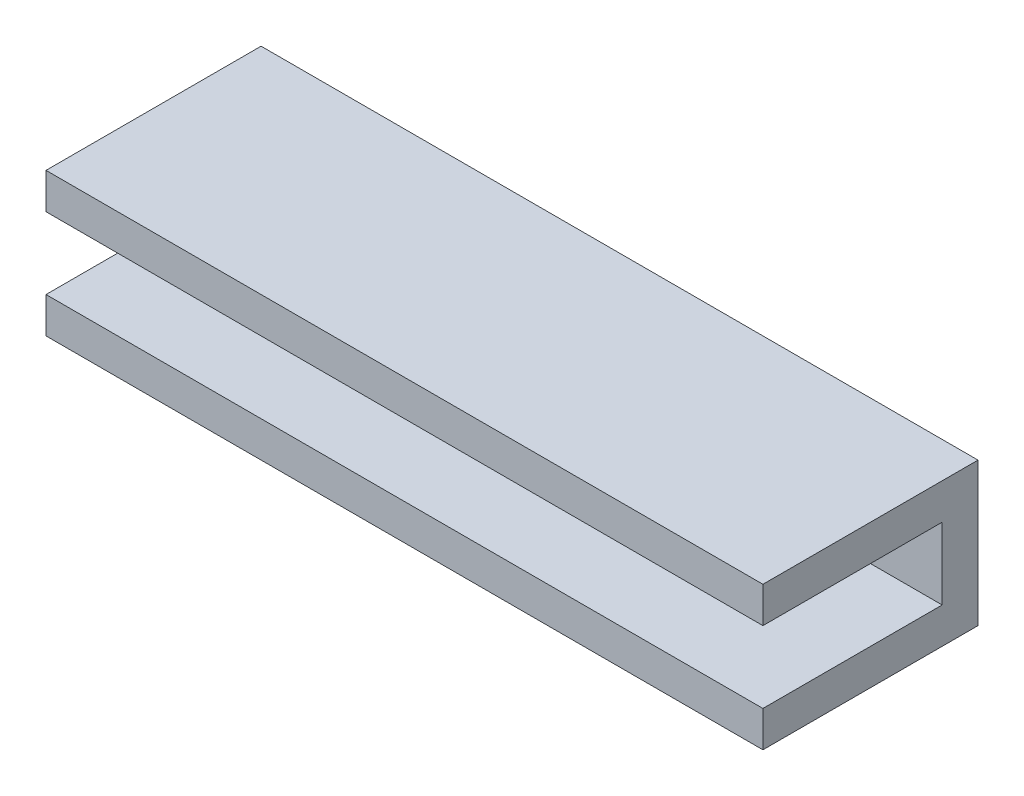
ISO-10303-21;
HEADER;
FILE_DESCRIPTION(('STEP AP214'),'2;1');
FILE_NAME('part.step','',(''),(''),'','','');
FILE_SCHEMA(('AUTOMOTIVE_DESIGN { 1 0 10303 214 1 1 1 1 }'));
ENDSEC;
DATA;
#1=APPLICATION_CONTEXT('core data for automotive mechanical design processes');
#2=APPLICATION_PROTOCOL_DEFINITION('international standard','automotive_design',2000,#1);
#3=PRODUCT_CONTEXT('',#1,'mechanical');
#4=PRODUCT('Part','Part','',(#3));
#5=PRODUCT_RELATED_PRODUCT_CATEGORY('part','',(#4));
#6=PRODUCT_DEFINITION_FORMATION('','',#4);
#7=PRODUCT_DEFINITION_CONTEXT('part definition',#1,'design');
#8=PRODUCT_DEFINITION('design','',#6,#7);
#9=PRODUCT_DEFINITION_SHAPE('','',#8);
#10=(LENGTH_UNIT() NAMED_UNIT(*) SI_UNIT(.MILLI.,.METRE.));
#11=(NAMED_UNIT(*) PLANE_ANGLE_UNIT() SI_UNIT($,.RADIAN.));
#12=(NAMED_UNIT(*) SI_UNIT($,.STERADIAN.) SOLID_ANGLE_UNIT());
#13=UNCERTAINTY_MEASURE_WITH_UNIT(LENGTH_MEASURE(1.E-05),#10,'distance_accuracy_value','');
#14=(GEOMETRIC_REPRESENTATION_CONTEXT(3) GLOBAL_UNCERTAINTY_ASSIGNED_CONTEXT((#13)) GLOBAL_UNIT_ASSIGNED_CONTEXT((#10,
#11,#12)) REPRESENTATION_CONTEXT('',''));
#15=CARTESIAN_POINT('',(0.,0.,0.));
#16=DIRECTION('',(0.,0.,1.));
#17=DIRECTION('',(1.,0.,0.));
#18=AXIS2_PLACEMENT_3D('',#15,#16,#17);
#19=CARTESIAN_POINT('',(0.,0.,30.));
#20=DIRECTION('',(0.,0.,1.));
#21=DIRECTION('',(1.,0.,0.));
#22=AXIS2_PLACEMENT_3D('',#19,#20,#21);
#23=PLANE('',#22);
#24=DIRECTION('',(0.,-1.,0.));
#25=VECTOR('',#24,1.);
#26=CARTESIAN_POINT('',(0.,20.,30.));
#27=LINE('',#26,#25);
#28=CARTESIAN_POINT('',(0.,20.,30.));
#29=VERTEX_POINT('',#28);
#30=CARTESIAN_POINT('',(0.,15.,30.));
#31=VERTEX_POINT('',#30);
#32=EDGE_CURVE('E143',#29,#31,#27,.T.);
#33=ORIENTED_EDGE('',*,*,#32,.T.);
#34=DIRECTION('',(1.,0.,0.));
#35=VECTOR('',#34,1.);
#36=CARTESIAN_POINT('',(0.,15.,30.));
#37=LINE('',#36,#35);
#38=CARTESIAN_POINT('',(100.,15.,30.));
#39=VERTEX_POINT('',#38);
#40=EDGE_CURVE('E165',#31,#39,#37,.T.);
#41=ORIENTED_EDGE('',*,*,#40,.T.);
#42=DIRECTION('',(0.,1.,0.));
#43=VECTOR('',#42,1.);
#44=CARTESIAN_POINT('',(100.,0.,30.));
#45=LINE('',#44,#43);
#46=CARTESIAN_POINT('',(100.,20.,30.));
#47=VERTEX_POINT('',#46);
#48=EDGE_CURVE('E155',#39,#47,#45,.T.);
#49=ORIENTED_EDGE('',*,*,#48,.T.);
#50=DIRECTION('',(-1.,0.,0.));
#51=VECTOR('',#50,1.);
#52=CARTESIAN_POINT('',(100.,20.,30.));
#53=LINE('',#52,#51);
#54=EDGE_CURVE('E66',#47,#29,#53,.T.);
#55=ORIENTED_EDGE('',*,*,#54,.T.);
#56=EDGE_LOOP('',(#33,#41,#49,#55));
#57=FACE_BOUND('',#56,.T.);
#58=ADVANCED_FACE('F44',(#57),#23,.T.);
#59=CARTESIAN_POINT('',(100.,0.,30.));
#60=DIRECTION('',(-1.,0.,0.));
#61=DIRECTION('',(0.,0.,1.));
#62=AXIS2_PLACEMENT_3D('',#59,#60,#61);
#63=PLANE('',#62);
#64=DIRECTION('',(0.,0.,-1.));
#65=VECTOR('',#64,1.);
#66=CARTESIAN_POINT('',(100.,5.,30.));
#67=LINE('',#66,#65);
#68=CARTESIAN_POINT('',(100.,5.,30.));
#69=VERTEX_POINT('',#68);
#70=CARTESIAN_POINT('',(100.,5.,5.));
#71=VERTEX_POINT('',#70);
#72=EDGE_CURVE('E64',#69,#71,#67,.T.);
#73=ORIENTED_EDGE('',*,*,#72,.F.);
#74=CARTESIAN_POINT('',(100.,0.,30.));
#75=VERTEX_POINT('',#74);
#76=EDGE_CURVE('E133',#75,#69,#45,.T.);
#77=ORIENTED_EDGE('',*,*,#76,.F.);
#78=DIRECTION('',(0.,0.,-1.));
#79=VECTOR('',#78,1.);
#80=CARTESIAN_POINT('',(100.,0.,30.));
#81=LINE('',#80,#79);
#82=CARTESIAN_POINT('',(100.,0.,0.));
#83=VERTEX_POINT('',#82);
#84=EDGE_CURVE('E53',#75,#83,#81,.T.);
#85=ORIENTED_EDGE('',*,*,#84,.T.);
#86=DIRECTION('',(0.,1.,0.));
#87=VECTOR('',#86,1.);
#88=CARTESIAN_POINT('',(100.,0.,0.));
#89=LINE('',#88,#87);
#90=CARTESIAN_POINT('',(100.,20.,0.));
#91=VERTEX_POINT('',#90);
#92=EDGE_CURVE('E148',#83,#91,#89,.T.);
#93=ORIENTED_EDGE('',*,*,#92,.T.);
#94=DIRECTION('',(0.,0.,-1.));
#95=VECTOR('',#94,1.);
#96=CARTESIAN_POINT('',(100.,20.,30.));
#97=LINE('',#96,#95);
#98=EDGE_CURVE('E166',#47,#91,#97,.T.);
#99=ORIENTED_EDGE('',*,*,#98,.F.);
#100=ORIENTED_EDGE('',*,*,#48,.F.);
#101=DIRECTION('',(0.,0.,1.));
#102=VECTOR('',#101,1.);
#103=CARTESIAN_POINT('',(100.,15.,5.));
#104=LINE('',#103,#102);
#105=CARTESIAN_POINT('',(100.,15.,5.));
#106=VERTEX_POINT('',#105);
#107=EDGE_CURVE('E129',#106,#39,#104,.T.);
#108=ORIENTED_EDGE('',*,*,#107,.F.);
#109=DIRECTION('',(0.,1.,0.));
#110=VECTOR('',#109,1.);
#111=CARTESIAN_POINT('',(100.,5.,5.));
#112=LINE('',#111,#110);
#113=EDGE_CURVE('E201',#71,#106,#112,.T.);
#114=ORIENTED_EDGE('',*,*,#113,.F.);
#115=EDGE_LOOP('',(#73,#77,#85,#93,#99,#100,#108,#114));
#116=FACE_BOUND('',#115,.T.);
#117=ADVANCED_FACE('F178',(#116),#63,.F.);
#118=CARTESIAN_POINT('',(0.,20.,30.));
#119=DIRECTION('',(1.,0.,0.));
#120=DIRECTION('',(0.,1.,0.));
#121=AXIS2_PLACEMENT_3D('',#118,#119,#120);
#122=PLANE('',#121);
#123=DIRECTION('',(0.,1.,0.));
#124=VECTOR('',#123,1.);
#125=CARTESIAN_POINT('',(0.,5.,5.));
#126=LINE('',#125,#124);
#127=CARTESIAN_POINT('',(0.,5.,5.));
#128=VERTEX_POINT('',#127);
#129=CARTESIAN_POINT('',(0.,15.,5.));
#130=VERTEX_POINT('',#129);
#131=EDGE_CURVE('E126',#128,#130,#126,.T.);
#132=ORIENTED_EDGE('',*,*,#131,.T.);
#133=DIRECTION('',(0.,0.,1.));
#134=VECTOR('',#133,1.);
#135=CARTESIAN_POINT('',(0.,15.,5.));
#136=LINE('',#135,#134);
#137=EDGE_CURVE('E138',#130,#31,#136,.T.);
#138=ORIENTED_EDGE('',*,*,#137,.T.);
#139=ORIENTED_EDGE('',*,*,#32,.F.);
#140=DIRECTION('',(0.,0.,-1.));
#141=VECTOR('',#140,1.);
#142=CARTESIAN_POINT('',(0.,20.,30.));
#143=LINE('',#142,#141);
#144=CARTESIAN_POINT('',(0.,20.,0.));
#145=VERTEX_POINT('',#144);
#146=EDGE_CURVE('E160',#29,#145,#143,.T.);
#147=ORIENTED_EDGE('',*,*,#146,.T.);
#148=DIRECTION('',(0.,-1.,0.));
#149=VECTOR('',#148,1.);
#150=CARTESIAN_POINT('',(0.,20.,0.));
#151=LINE('',#150,#149);
#152=CARTESIAN_POINT('',(0.,0.,0.));
#153=VERTEX_POINT('',#152);
#154=EDGE_CURVE('E158',#145,#153,#151,.T.);
#155=ORIENTED_EDGE('',*,*,#154,.T.);
#156=DIRECTION('',(0.,0.,-1.));
#157=VECTOR('',#156,1.);
#158=CARTESIAN_POINT('',(0.,0.,30.));
#159=LINE('',#158,#157);
#160=CARTESIAN_POINT('',(0.,0.,30.));
#161=VERTEX_POINT('',#160);
#162=EDGE_CURVE('E11',#161,#153,#159,.T.);
#163=ORIENTED_EDGE('',*,*,#162,.F.);
#164=CARTESIAN_POINT('',(0.,5.,30.));
#165=VERTEX_POINT('',#164);
#166=EDGE_CURVE('E97',#165,#161,#27,.T.);
#167=ORIENTED_EDGE('',*,*,#166,.F.);
#168=DIRECTION('',(0.,0.,-1.));
#169=VECTOR('',#168,1.);
#170=CARTESIAN_POINT('',(0.,5.,30.));
#171=LINE('',#170,#169);
#172=EDGE_CURVE('E117',#165,#128,#171,.T.);
#173=ORIENTED_EDGE('',*,*,#172,.T.);
#174=EDGE_LOOP('',(#132,#138,#139,#147,#155,#163,#167,#173));
#175=FACE_BOUND('',#174,.T.);
#176=ADVANCED_FACE('F50',(#175),#122,.F.);
#177=CARTESIAN_POINT('',(0.,0.,30.));
#178=DIRECTION('',(0.,1.,0.));
#179=DIRECTION('',(0.,0.,1.));
#180=AXIS2_PLACEMENT_3D('',#177,#178,#179);
#181=PLANE('',#180);
#182=DIRECTION('',(1.,0.,0.));
#183=VECTOR('',#182,1.);
#184=CARTESIAN_POINT('',(0.,0.,0.));
#185=LINE('',#184,#183);
#186=EDGE_CURVE('E161',#153,#83,#185,.T.);
#187=ORIENTED_EDGE('',*,*,#186,.T.);
#188=ORIENTED_EDGE('',*,*,#84,.F.);
#189=DIRECTION('',(1.,0.,0.));
#190=VECTOR('',#189,1.);
#191=CARTESIAN_POINT('',(0.,0.,30.));
#192=LINE('',#191,#190);
#193=EDGE_CURVE('E144',#161,#75,#192,.T.);
#194=ORIENTED_EDGE('',*,*,#193,.F.);
#195=ORIENTED_EDGE('',*,*,#162,.T.);
#196=EDGE_LOOP('',(#187,#188,#194,#195));
#197=FACE_BOUND('',#196,.T.);
#198=ADVANCED_FACE('F253',(#197),#181,.F.);
#199=CARTESIAN_POINT('',(100.,20.,30.));
#200=DIRECTION('',(0.,-1.,0.));
#201=DIRECTION('',(1.,0.,0.));
#202=AXIS2_PLACEMENT_3D('',#199,#200,#201);
#203=PLANE('',#202);
#204=DIRECTION('',(-1.,0.,0.));
#205=VECTOR('',#204,1.);
#206=CARTESIAN_POINT('',(100.,20.,0.));
#207=LINE('',#206,#205);
#208=EDGE_CURVE('E93',#91,#145,#207,.T.);
#209=ORIENTED_EDGE('',*,*,#208,.T.);
#210=ORIENTED_EDGE('',*,*,#146,.F.);
#211=ORIENTED_EDGE('',*,*,#54,.F.);
#212=ORIENTED_EDGE('',*,*,#98,.T.);
#213=EDGE_LOOP('',(#209,#210,#211,#212));
#214=FACE_BOUND('',#213,.T.);
#215=ADVANCED_FACE('F184',(#214),#203,.F.);
#216=DIRECTION('',(1.,0.,0.));
#217=VECTOR('',#216,1.);
#218=CARTESIAN_POINT('',(0.,5.,30.));
#219=LINE('',#218,#217);
#220=EDGE_CURVE('E124',#165,#69,#219,.T.);
#221=ORIENTED_EDGE('',*,*,#220,.F.);
#222=ORIENTED_EDGE('',*,*,#166,.T.);
#223=ORIENTED_EDGE('',*,*,#193,.T.);
#224=ORIENTED_EDGE('',*,*,#76,.T.);
#225=EDGE_LOOP('',(#221,#222,#223,#224));
#226=FACE_BOUND('',#225,.T.);
#227=ADVANCED_FACE('F131',(#226),#23,.T.);
#228=CARTESIAN_POINT('',(0.,0.,0.));
#229=DIRECTION('',(0.,0.,1.));
#230=DIRECTION('',(1.,0.,0.));
#231=AXIS2_PLACEMENT_3D('',#228,#229,#230);
#232=PLANE('',#231);
#233=CARTESIAN_POINT('',(50.,10.,0.));
#234=DIRECTION('',(0.,0.,1.));
#235=DIRECTION('',(1.,0.,0.));
#236=AXIS2_PLACEMENT_3D('',#233,#234,#235);
#237=CIRCLE('',#236,2.);
#238=CARTESIAN_POINT('',(52.,10.,0.));
#239=VERTEX_POINT('',#238);
#240=EDGE_CURVE('E210',#239,#239,#237,.T.);
#241=ORIENTED_EDGE('',*,*,#240,.T.);
#242=EDGE_LOOP('',(#241));
#243=FACE_BOUND('',#242,.T.);
#244=ORIENTED_EDGE('',*,*,#154,.F.);
#245=ORIENTED_EDGE('',*,*,#208,.F.);
#246=ORIENTED_EDGE('',*,*,#92,.F.);
#247=ORIENTED_EDGE('',*,*,#186,.F.);
#248=EDGE_LOOP('',(#244,#245,#246,#247));
#249=FACE_BOUND('',#248,.T.);
#250=ADVANCED_FACE('F182',(#243,#249),#232,.F.);
#251=CARTESIAN_POINT('',(0.,15.,5.));
#252=DIRECTION('',(0.,1.,0.));
#253=DIRECTION('',(0.,0.,1.));
#254=AXIS2_PLACEMENT_3D('',#251,#252,#253);
#255=PLANE('',#254);
#256=ORIENTED_EDGE('',*,*,#107,.T.);
#257=ORIENTED_EDGE('',*,*,#40,.F.);
#258=ORIENTED_EDGE('',*,*,#137,.F.);
#259=DIRECTION('',(1.,0.,0.));
#260=VECTOR('',#259,1.);
#261=CARTESIAN_POINT('',(0.,15.,5.));
#262=LINE('',#261,#260);
#263=EDGE_CURVE('E192',#130,#106,#262,.T.);
#264=ORIENTED_EDGE('',*,*,#263,.T.);
#265=EDGE_LOOP('',(#256,#257,#258,#264));
#266=FACE_BOUND('',#265,.T.);
#267=ADVANCED_FACE('F227',(#266),#255,.F.);
#268=CARTESIAN_POINT('',(0.,5.,5.));
#269=DIRECTION('',(0.,0.,-1.));
#270=DIRECTION('',(0.,1.,0.));
#271=AXIS2_PLACEMENT_3D('',#268,#269,#270);
#272=PLANE('',#271);
#273=CARTESIAN_POINT('',(50.,10.,5.));
#274=DIRECTION('',(0.,0.,1.));
#275=DIRECTION('',(1.,0.,0.));
#276=AXIS2_PLACEMENT_3D('',#273,#274,#275);
#277=CIRCLE('',#276,2.);
#278=CARTESIAN_POINT('',(52.,10.,5.));
#279=VERTEX_POINT('',#278);
#280=EDGE_CURVE('E212',#279,#279,#277,.T.);
#281=ORIENTED_EDGE('',*,*,#280,.F.);
#282=EDGE_LOOP('',(#281));
#283=FACE_BOUND('',#282,.T.);
#284=ORIENTED_EDGE('',*,*,#113,.T.);
#285=ORIENTED_EDGE('',*,*,#263,.F.);
#286=ORIENTED_EDGE('',*,*,#131,.F.);
#287=DIRECTION('',(1.,0.,0.));
#288=VECTOR('',#287,1.);
#289=CARTESIAN_POINT('',(0.,5.,5.));
#290=LINE('',#289,#288);
#291=EDGE_CURVE('E122',#128,#71,#290,.T.);
#292=ORIENTED_EDGE('',*,*,#291,.T.);
#293=EDGE_LOOP('',(#284,#285,#286,#292));
#294=FACE_BOUND('',#293,.T.);
#295=ADVANCED_FACE('F205',(#283,#294),#272,.F.);
#296=CARTESIAN_POINT('',(0.,5.,30.));
#297=DIRECTION('',(0.,-1.,0.));
#298=DIRECTION('',(0.,0.,-1.));
#299=AXIS2_PLACEMENT_3D('',#296,#297,#298);
#300=PLANE('',#299);
#301=ORIENTED_EDGE('',*,*,#72,.T.);
#302=ORIENTED_EDGE('',*,*,#291,.F.);
#303=ORIENTED_EDGE('',*,*,#172,.F.);
#304=ORIENTED_EDGE('',*,*,#220,.T.);
#305=EDGE_LOOP('',(#301,#302,#303,#304));
#306=FACE_BOUND('',#305,.T.);
#307=ADVANCED_FACE('F123',(#306),#300,.F.);
#308=CARTESIAN_POINT('',(50.,10.,0.));
#309=DIRECTION('',(0.,0.,1.));
#310=DIRECTION('',(1.,0.,0.));
#311=AXIS2_PLACEMENT_3D('',#308,#309,#310);
#312=CYLINDRICAL_SURFACE('',#311,2.);
#313=ORIENTED_EDGE('',*,*,#240,.F.);
#314=EDGE_LOOP('',(#313));
#315=FACE_BOUND('',#314,.T.);
#316=ORIENTED_EDGE('',*,*,#280,.T.);
#317=EDGE_LOOP('',(#316));
#318=FACE_BOUND('',#317,.T.);
#319=ADVANCED_FACE('F224',(#315,#318),#312,.F.);
#320=CLOSED_SHELL('',(#58,#117,#176,#198,#215,#227,#250,#267,#295,#307,#319));
#321=MANIFOLD_SOLID_BREP('B2',#320);
#322=ADVANCED_BREP_SHAPE_REPRESENTATION('',(#18,#321),#14);
#323=SHAPE_DEFINITION_REPRESENTATION(#9,#322);
ENDSEC;
END-ISO-10303-21;
